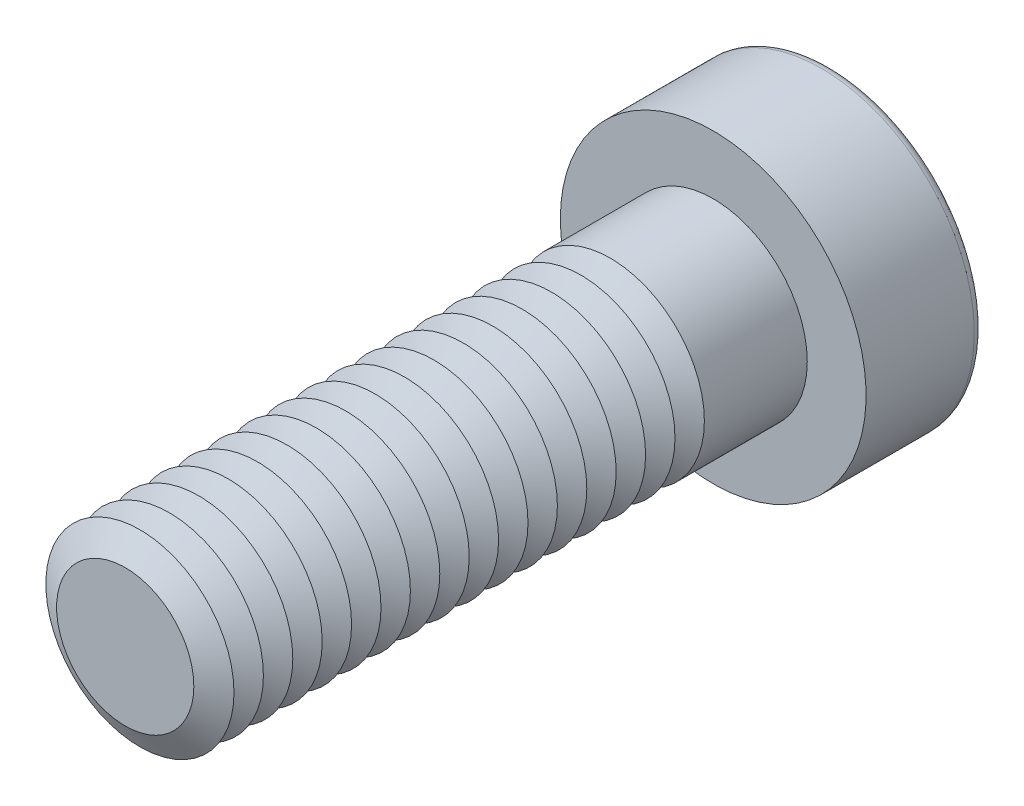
ISO-10303-21;
HEADER;
FILE_DESCRIPTION(('STEP AP214'),'2;1');
FILE_NAME('part.step','',(''),(''),'','','');
FILE_SCHEMA(('AUTOMOTIVE_DESIGN { 1 0 10303 214 1 1 1 1 }'));
ENDSEC;
DATA;
#1=APPLICATION_CONTEXT('core data for automotive mechanical design processes');
#2=APPLICATION_PROTOCOL_DEFINITION('international standard','automotive_design',2000,#1);
#3=PRODUCT_CONTEXT('',#1,'mechanical');
#4=PRODUCT('Part','Part','',(#3));
#5=PRODUCT_RELATED_PRODUCT_CATEGORY('part','',(#4));
#6=PRODUCT_DEFINITION_FORMATION('','',#4);
#7=PRODUCT_DEFINITION_CONTEXT('part definition',#1,'design');
#8=PRODUCT_DEFINITION('design','',#6,#7);
#9=PRODUCT_DEFINITION_SHAPE('','',#8);
#10=(LENGTH_UNIT() NAMED_UNIT(*) SI_UNIT(.MILLI.,.METRE.));
#11=(NAMED_UNIT(*) PLANE_ANGLE_UNIT() SI_UNIT($,.RADIAN.));
#12=(NAMED_UNIT(*) SI_UNIT($,.STERADIAN.) SOLID_ANGLE_UNIT());
#13=UNCERTAINTY_MEASURE_WITH_UNIT(LENGTH_MEASURE(1.E-05),#10,'distance_accuracy_value','');
#14=(GEOMETRIC_REPRESENTATION_CONTEXT(3) GLOBAL_UNCERTAINTY_ASSIGNED_CONTEXT((#13)) GLOBAL_UNIT_ASSIGNED_CONTEXT((#10,
#11,#12)) REPRESENTATION_CONTEXT('',''));
#15=CARTESIAN_POINT('',(0.,0.,0.));
#16=DIRECTION('',(0.,0.,1.));
#17=DIRECTION('',(1.,0.,0.));
#18=AXIS2_PLACEMENT_3D('',#15,#16,#17);
#19=CARTESIAN_POINT('',(0.,0.,20.625));
#20=DIRECTION('',(0.,0.,1.));
#21=DIRECTION('',(1.,0.,0.));
#22=AXIS2_PLACEMENT_3D('',#19,#20,#21);
#23=CONICAL_SURFACE('',#22,4.,1.0471975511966);
#24=CARTESIAN_POINT('',(0.,0.,20.));
#25=DIRECTION('',(0.,0.,1.));
#26=DIRECTION('',(1.,0.,0.));
#27=AXIS2_PLACEMENT_3D('',#24,#25,#26);
#28=CIRCLE('',#27,2.91746824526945);
#29=CARTESIAN_POINT('',(2.91746824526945,0.,20.));
#30=VERTEX_POINT('',#29);
#31=EDGE_CURVE('E313',#30,#30,#28,.T.);
#32=ORIENTED_EDGE('',*,*,#31,.T.);
#33=EDGE_LOOP('',(#32));
#34=FACE_BOUND('',#33,.T.);
#35=CARTESIAN_POINT('',(0.,0.,20.625));
#36=DIRECTION('',(0.,0.,1.));
#37=DIRECTION('',(1.,0.,0.));
#38=AXIS2_PLACEMENT_3D('',#35,#36,#37);
#39=CIRCLE('',#38,4.);
#40=CARTESIAN_POINT('',(4.,0.,20.625));
#41=VERTEX_POINT('',#40);
#42=EDGE_CURVE('E316',#41,#41,#39,.T.);
#43=ORIENTED_EDGE('',*,*,#42,.F.);
#44=EDGE_LOOP('',(#43));
#45=FACE_BOUND('',#44,.T.);
#46=ADVANCED_FACE('F39',(#34,#45),#23,.T.);
#47=CARTESIAN_POINT('',(0.,0.,20.));
#48=DIRECTION('',(0.,0.,-1.));
#49=DIRECTION('',(-1.,0.,0.));
#50=AXIS2_PLACEMENT_3D('',#47,#48,#49);
#51=CONICAL_SURFACE('',#50,2.91746824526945,1.0471975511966);
#52=CARTESIAN_POINT('',(0.,0.,19.375));
#53=DIRECTION('',(0.,0.,1.));
#54=DIRECTION('',(1.,0.,0.));
#55=AXIS2_PLACEMENT_3D('',#52,#53,#54);
#56=CIRCLE('',#55,4.);
#57=CARTESIAN_POINT('',(4.,0.,19.375));
#58=VERTEX_POINT('',#57);
#59=EDGE_CURVE('E323',#58,#58,#56,.T.);
#60=ORIENTED_EDGE('',*,*,#59,.T.);
#61=EDGE_LOOP('',(#60));
#62=FACE_BOUND('',#61,.T.);
#63=ORIENTED_EDGE('',*,*,#31,.F.);
#64=EDGE_LOOP('',(#63));
#65=FACE_BOUND('',#64,.T.);
#66=ADVANCED_FACE('F245',(#62,#65),#51,.T.);
#67=CARTESIAN_POINT('',(0.,0.,25.));
#68=DIRECTION('',(0.,0.,1.));
#69=DIRECTION('',(1.,0.,0.));
#70=AXIS2_PLACEMENT_3D('',#67,#68,#69);
#71=PLANE('',#70);
#72=CARTESIAN_POINT('',(0.,0.,25.));
#73=DIRECTION('',(0.,0.,1.));
#74=DIRECTION('',(1.,0.,0.));
#75=AXIS2_PLACEMENT_3D('',#72,#73,#74);
#76=CIRCLE('',#75,2.91746824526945);
#77=CARTESIAN_POINT('',(2.91746824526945,0.,25.));
#78=VERTEX_POINT('',#77);
#79=EDGE_CURVE('E174',#78,#78,#76,.T.);
#80=ORIENTED_EDGE('',*,*,#79,.T.);
#81=EDGE_LOOP('',(#80));
#82=FACE_BOUND('',#81,.T.);
#83=ADVANCED_FACE('F251',(#82),#71,.T.);
#84=CARTESIAN_POINT('',(0.,0.,25.));
#85=DIRECTION('',(0.,0.,-1.));
#86=DIRECTION('',(-1.,0.,0.));
#87=AXIS2_PLACEMENT_3D('',#84,#85,#86);
#88=CONICAL_SURFACE('',#87,2.91746824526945,1.0471975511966);
#89=CARTESIAN_POINT('',(0.,0.,24.375));
#90=DIRECTION('',(0.,0.,1.));
#91=DIRECTION('',(1.,0.,0.));
#92=AXIS2_PLACEMENT_3D('',#89,#90,#91);
#93=CIRCLE('',#92,4.);
#94=CARTESIAN_POINT('',(4.,0.,24.375));
#95=VERTEX_POINT('',#94);
#96=EDGE_CURVE('E291',#95,#95,#93,.T.);
#97=ORIENTED_EDGE('',*,*,#96,.T.);
#98=EDGE_LOOP('',(#97));
#99=FACE_BOUND('',#98,.T.);
#100=ORIENTED_EDGE('',*,*,#79,.F.);
#101=EDGE_LOOP('',(#100));
#102=FACE_BOUND('',#101,.T.);
#103=ADVANCED_FACE('F199',(#99,#102),#88,.T.);
#104=CARTESIAN_POINT('',(0.,0.,24.375));
#105=DIRECTION('',(0.,0.,1.));
#106=DIRECTION('',(1.,0.,0.));
#107=AXIS2_PLACEMENT_3D('',#104,#105,#106);
#108=CONICAL_SURFACE('',#107,4.,1.0471975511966);
#109=CARTESIAN_POINT('',(0.,0.,23.75));
#110=DIRECTION('',(0.,0.,1.));
#111=DIRECTION('',(1.,0.,0.));
#112=AXIS2_PLACEMENT_3D('',#109,#110,#111);
#113=CIRCLE('',#112,2.91746824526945);
#114=CARTESIAN_POINT('',(2.91746824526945,0.,23.75));
#115=VERTEX_POINT('',#114);
#116=EDGE_CURVE('E288',#115,#115,#113,.T.);
#117=ORIENTED_EDGE('',*,*,#116,.T.);
#118=EDGE_LOOP('',(#117));
#119=FACE_BOUND('',#118,.T.);
#120=ORIENTED_EDGE('',*,*,#96,.F.);
#121=EDGE_LOOP('',(#120));
#122=FACE_BOUND('',#121,.T.);
#123=ADVANCED_FACE('F277',(#119,#122),#108,.T.);
#124=CARTESIAN_POINT('',(0.,0.,23.75));
#125=DIRECTION('',(0.,0.,-1.));
#126=DIRECTION('',(-1.,0.,0.));
#127=AXIS2_PLACEMENT_3D('',#124,#125,#126);
#128=CONICAL_SURFACE('',#127,2.91746824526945,1.0471975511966);
#129=CARTESIAN_POINT('',(0.,0.,23.125));
#130=DIRECTION('',(0.,0.,1.));
#131=DIRECTION('',(1.,0.,0.));
#132=AXIS2_PLACEMENT_3D('',#129,#130,#131);
#133=CIRCLE('',#132,4.);
#134=CARTESIAN_POINT('',(4.,0.,23.125));
#135=VERTEX_POINT('',#134);
#136=EDGE_CURVE('E299',#135,#135,#133,.T.);
#137=ORIENTED_EDGE('',*,*,#136,.T.);
#138=EDGE_LOOP('',(#137));
#139=FACE_BOUND('',#138,.T.);
#140=ORIENTED_EDGE('',*,*,#116,.F.);
#141=EDGE_LOOP('',(#140));
#142=FACE_BOUND('',#141,.T.);
#143=ADVANCED_FACE('F274',(#139,#142),#128,.T.);
#144=CARTESIAN_POINT('',(0.,0.,23.125));
#145=DIRECTION('',(0.,0.,1.));
#146=DIRECTION('',(1.,0.,0.));
#147=AXIS2_PLACEMENT_3D('',#144,#145,#146);
#148=CONICAL_SURFACE('',#147,4.,1.0471975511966);
#149=CARTESIAN_POINT('',(0.,0.,22.5));
#150=DIRECTION('',(0.,0.,1.));
#151=DIRECTION('',(1.,0.,0.));
#152=AXIS2_PLACEMENT_3D('',#149,#150,#151);
#153=CIRCLE('',#152,2.91746824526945);
#154=CARTESIAN_POINT('',(2.91746824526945,0.,22.5));
#155=VERTEX_POINT('',#154);
#156=EDGE_CURVE('E293',#155,#155,#153,.T.);
#157=ORIENTED_EDGE('',*,*,#156,.T.);
#158=EDGE_LOOP('',(#157));
#159=FACE_BOUND('',#158,.T.);
#160=ORIENTED_EDGE('',*,*,#136,.F.);
#161=EDGE_LOOP('',(#160));
#162=FACE_BOUND('',#161,.T.);
#163=ADVANCED_FACE('F270',(#159,#162),#148,.T.);
#164=CARTESIAN_POINT('',(0.,0.,22.5));
#165=DIRECTION('',(0.,0.,-1.));
#166=DIRECTION('',(-1.,0.,0.));
#167=AXIS2_PLACEMENT_3D('',#164,#165,#166);
#168=CONICAL_SURFACE('',#167,2.91746824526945,1.0471975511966);
#169=CARTESIAN_POINT('',(0.,0.,21.875));
#170=DIRECTION('',(0.,0.,1.));
#171=DIRECTION('',(1.,0.,0.));
#172=AXIS2_PLACEMENT_3D('',#169,#170,#171);
#173=CIRCLE('',#172,4.);
#174=CARTESIAN_POINT('',(4.,0.,21.875));
#175=VERTEX_POINT('',#174);
#176=EDGE_CURVE('E309',#175,#175,#173,.T.);
#177=ORIENTED_EDGE('',*,*,#176,.T.);
#178=EDGE_LOOP('',(#177));
#179=FACE_BOUND('',#178,.T.);
#180=ORIENTED_EDGE('',*,*,#156,.F.);
#181=EDGE_LOOP('',(#180));
#182=FACE_BOUND('',#181,.T.);
#183=ADVANCED_FACE('F266',(#179,#182),#168,.T.);
#184=CARTESIAN_POINT('',(0.,0.,21.875));
#185=DIRECTION('',(0.,0.,1.));
#186=DIRECTION('',(1.,0.,0.));
#187=AXIS2_PLACEMENT_3D('',#184,#185,#186);
#188=CONICAL_SURFACE('',#187,4.,1.0471975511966);
#189=CARTESIAN_POINT('',(0.,0.,21.25));
#190=DIRECTION('',(0.,0.,1.));
#191=DIRECTION('',(1.,0.,0.));
#192=AXIS2_PLACEMENT_3D('',#189,#190,#191);
#193=CIRCLE('',#192,2.91746824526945);
#194=CARTESIAN_POINT('',(2.91746824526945,0.,21.25));
#195=VERTEX_POINT('',#194);
#196=EDGE_CURVE('E305',#195,#195,#193,.T.);
#197=ORIENTED_EDGE('',*,*,#196,.T.);
#198=EDGE_LOOP('',(#197));
#199=FACE_BOUND('',#198,.T.);
#200=ORIENTED_EDGE('',*,*,#176,.F.);
#201=EDGE_LOOP('',(#200));
#202=FACE_BOUND('',#201,.T.);
#203=ADVANCED_FACE('F262',(#199,#202),#188,.T.);
#204=CARTESIAN_POINT('',(0.,0.,21.25));
#205=DIRECTION('',(0.,0.,-1.));
#206=DIRECTION('',(-1.,0.,0.));
#207=AXIS2_PLACEMENT_3D('',#204,#205,#206);
#208=CONICAL_SURFACE('',#207,2.91746824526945,1.0471975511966);
#209=ORIENTED_EDGE('',*,*,#42,.T.);
#210=EDGE_LOOP('',(#209));
#211=FACE_BOUND('',#210,.T.);
#212=ORIENTED_EDGE('',*,*,#196,.F.);
#213=EDGE_LOOP('',(#212));
#214=FACE_BOUND('',#213,.T.);
#215=ADVANCED_FACE('F258',(#211,#214),#208,.T.);
#216=CARTESIAN_POINT('',(0.,0.,19.375));
#217=DIRECTION('',(0.,0.,1.));
#218=DIRECTION('',(1.,0.,0.));
#219=AXIS2_PLACEMENT_3D('',#216,#217,#218);
#220=CONICAL_SURFACE('',#219,4.,1.0471975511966);
#221=CARTESIAN_POINT('',(0.,0.,18.75));
#222=DIRECTION('',(0.,0.,1.));
#223=DIRECTION('',(1.,0.,0.));
#224=AXIS2_PLACEMENT_3D('',#221,#222,#223);
#225=CIRCLE('',#224,2.91746824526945);
#226=CARTESIAN_POINT('',(2.91746824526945,0.,18.75));
#227=VERTEX_POINT('',#226);
#228=EDGE_CURVE('E319',#227,#227,#225,.T.);
#229=ORIENTED_EDGE('',*,*,#228,.T.);
#230=EDGE_LOOP('',(#229));
#231=FACE_BOUND('',#230,.T.);
#232=ORIENTED_EDGE('',*,*,#59,.F.);
#233=EDGE_LOOP('',(#232));
#234=FACE_BOUND('',#233,.T.);
#235=ADVANCED_FACE('F261',(#231,#234),#220,.T.);
#236=CARTESIAN_POINT('',(0.,0.,18.75));
#237=DIRECTION('',(0.,0.,-1.));
#238=DIRECTION('',(-1.,0.,0.));
#239=AXIS2_PLACEMENT_3D('',#236,#237,#238);
#240=CONICAL_SURFACE('',#239,2.91746824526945,1.0471975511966);
#241=CARTESIAN_POINT('',(0.,0.,18.125));
#242=DIRECTION('',(0.,0.,1.));
#243=DIRECTION('',(1.,0.,0.));
#244=AXIS2_PLACEMENT_3D('',#241,#242,#243);
#245=CIRCLE('',#244,4.);
#246=CARTESIAN_POINT('',(4.,0.,18.125));
#247=VERTEX_POINT('',#246);
#248=EDGE_CURVE('E330',#247,#247,#245,.T.);
#249=ORIENTED_EDGE('',*,*,#248,.T.);
#250=EDGE_LOOP('',(#249));
#251=FACE_BOUND('',#250,.T.);
#252=ORIENTED_EDGE('',*,*,#228,.F.);
#253=EDGE_LOOP('',(#252));
#254=FACE_BOUND('',#253,.T.);
#255=ADVANCED_FACE('F511',(#251,#254),#240,.T.);
#256=CARTESIAN_POINT('',(0.,0.,18.125));
#257=DIRECTION('',(0.,0.,1.));
#258=DIRECTION('',(1.,0.,0.));
#259=AXIS2_PLACEMENT_3D('',#256,#257,#258);
#260=CONICAL_SURFACE('',#259,4.,1.0471975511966);
#261=CARTESIAN_POINT('',(0.,0.,17.5));
#262=DIRECTION('',(0.,0.,1.));
#263=DIRECTION('',(1.,0.,0.));
#264=AXIS2_PLACEMENT_3D('',#261,#262,#263);
#265=CIRCLE('',#264,2.91746824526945);
#266=CARTESIAN_POINT('',(2.91746824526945,0.,17.5));
#267=VERTEX_POINT('',#266);
#268=EDGE_CURVE('E327',#267,#267,#265,.T.);
#269=ORIENTED_EDGE('',*,*,#268,.T.);
#270=EDGE_LOOP('',(#269));
#271=FACE_BOUND('',#270,.T.);
#272=ORIENTED_EDGE('',*,*,#248,.F.);
#273=EDGE_LOOP('',(#272));
#274=FACE_BOUND('',#273,.T.);
#275=ADVANCED_FACE('F507',(#271,#274),#260,.T.);
#276=CARTESIAN_POINT('',(0.,0.,17.5));
#277=DIRECTION('',(0.,0.,-1.));
#278=DIRECTION('',(-1.,0.,0.));
#279=AXIS2_PLACEMENT_3D('',#276,#277,#278);
#280=CONICAL_SURFACE('',#279,2.91746824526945,1.0471975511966);
#281=CARTESIAN_POINT('',(0.,0.,16.875));
#282=DIRECTION('',(0.,0.,1.));
#283=DIRECTION('',(1.,0.,0.));
#284=AXIS2_PLACEMENT_3D('',#281,#282,#283);
#285=CIRCLE('',#284,4.);
#286=CARTESIAN_POINT('',(4.,0.,16.875));
#287=VERTEX_POINT('',#286);
#288=EDGE_CURVE('E338',#287,#287,#285,.T.);
#289=ORIENTED_EDGE('',*,*,#288,.T.);
#290=EDGE_LOOP('',(#289));
#291=FACE_BOUND('',#290,.T.);
#292=ORIENTED_EDGE('',*,*,#268,.F.);
#293=EDGE_LOOP('',(#292));
#294=FACE_BOUND('',#293,.T.);
#295=ADVANCED_FACE('F503',(#291,#294),#280,.T.);
#296=CARTESIAN_POINT('',(0.,0.,16.875));
#297=DIRECTION('',(0.,0.,1.));
#298=DIRECTION('',(1.,0.,0.));
#299=AXIS2_PLACEMENT_3D('',#296,#297,#298);
#300=CONICAL_SURFACE('',#299,4.,1.0471975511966);
#301=CARTESIAN_POINT('',(0.,0.,16.25));
#302=DIRECTION('',(0.,0.,1.));
#303=DIRECTION('',(1.,0.,0.));
#304=AXIS2_PLACEMENT_3D('',#301,#302,#303);
#305=CIRCLE('',#304,2.91746824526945);
#306=CARTESIAN_POINT('',(2.91746824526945,0.,16.25));
#307=VERTEX_POINT('',#306);
#308=EDGE_CURVE('E334',#307,#307,#305,.T.);
#309=ORIENTED_EDGE('',*,*,#308,.T.);
#310=EDGE_LOOP('',(#309));
#311=FACE_BOUND('',#310,.T.);
#312=ORIENTED_EDGE('',*,*,#288,.F.);
#313=EDGE_LOOP('',(#312));
#314=FACE_BOUND('',#313,.T.);
#315=ADVANCED_FACE('F499',(#311,#314),#300,.T.);
#316=CARTESIAN_POINT('',(0.,0.,16.25));
#317=DIRECTION('',(0.,0.,-1.));
#318=DIRECTION('',(-1.,0.,0.));
#319=AXIS2_PLACEMENT_3D('',#316,#317,#318);
#320=CONICAL_SURFACE('',#319,2.91746824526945,1.0471975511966);
#321=CARTESIAN_POINT('',(0.,0.,15.625));
#322=DIRECTION('',(0.,0.,1.));
#323=DIRECTION('',(1.,0.,0.));
#324=AXIS2_PLACEMENT_3D('',#321,#322,#323);
#325=CIRCLE('',#324,4.);
#326=CARTESIAN_POINT('',(4.,0.,15.625));
#327=VERTEX_POINT('',#326);
#328=EDGE_CURVE('E346',#327,#327,#325,.T.);
#329=ORIENTED_EDGE('',*,*,#328,.T.);
#330=EDGE_LOOP('',(#329));
#331=FACE_BOUND('',#330,.T.);
#332=ORIENTED_EDGE('',*,*,#308,.F.);
#333=EDGE_LOOP('',(#332));
#334=FACE_BOUND('',#333,.T.);
#335=ADVANCED_FACE('F495',(#331,#334),#320,.T.);
#336=CARTESIAN_POINT('',(0.,0.,15.625));
#337=DIRECTION('',(0.,0.,1.));
#338=DIRECTION('',(1.,0.,0.));
#339=AXIS2_PLACEMENT_3D('',#336,#337,#338);
#340=CONICAL_SURFACE('',#339,4.,1.0471975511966);
#341=CARTESIAN_POINT('',(0.,0.,15.));
#342=DIRECTION('',(0.,0.,1.));
#343=DIRECTION('',(1.,0.,0.));
#344=AXIS2_PLACEMENT_3D('',#341,#342,#343);
#345=CIRCLE('',#344,2.91746824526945);
#346=CARTESIAN_POINT('',(2.91746824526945,0.,15.));
#347=VERTEX_POINT('',#346);
#348=EDGE_CURVE('E342',#347,#347,#345,.T.);
#349=ORIENTED_EDGE('',*,*,#348,.T.);
#350=EDGE_LOOP('',(#349));
#351=FACE_BOUND('',#350,.T.);
#352=ORIENTED_EDGE('',*,*,#328,.F.);
#353=EDGE_LOOP('',(#352));
#354=FACE_BOUND('',#353,.T.);
#355=ADVANCED_FACE('F491',(#351,#354),#340,.T.);
#356=CARTESIAN_POINT('',(0.,0.,15.));
#357=DIRECTION('',(0.,0.,-1.));
#358=DIRECTION('',(-1.,0.,0.));
#359=AXIS2_PLACEMENT_3D('',#356,#357,#358);
#360=CONICAL_SURFACE('',#359,2.91746824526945,1.0471975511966);
#361=CARTESIAN_POINT('',(0.,0.,14.375));
#362=DIRECTION('',(0.,0.,1.));
#363=DIRECTION('',(1.,0.,0.));
#364=AXIS2_PLACEMENT_3D('',#361,#362,#363);
#365=CIRCLE('',#364,4.);
#366=CARTESIAN_POINT('',(4.,0.,14.375));
#367=VERTEX_POINT('',#366);
#368=EDGE_CURVE('E354',#367,#367,#365,.T.);
#369=ORIENTED_EDGE('',*,*,#368,.T.);
#370=EDGE_LOOP('',(#369));
#371=FACE_BOUND('',#370,.T.);
#372=ORIENTED_EDGE('',*,*,#348,.F.);
#373=EDGE_LOOP('',(#372));
#374=FACE_BOUND('',#373,.T.);
#375=ADVANCED_FACE('F487',(#371,#374),#360,.T.);
#376=CARTESIAN_POINT('',(0.,0.,14.375));
#377=DIRECTION('',(0.,0.,1.));
#378=DIRECTION('',(1.,0.,0.));
#379=AXIS2_PLACEMENT_3D('',#376,#377,#378);
#380=CONICAL_SURFACE('',#379,4.,1.0471975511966);
#381=CARTESIAN_POINT('',(0.,0.,13.75));
#382=DIRECTION('',(0.,0.,1.));
#383=DIRECTION('',(1.,0.,0.));
#384=AXIS2_PLACEMENT_3D('',#381,#382,#383);
#385=CIRCLE('',#384,2.91746824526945);
#386=CARTESIAN_POINT('',(2.91746824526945,0.,13.75));
#387=VERTEX_POINT('',#386);
#388=EDGE_CURVE('E350',#387,#387,#385,.T.);
#389=ORIENTED_EDGE('',*,*,#388,.T.);
#390=EDGE_LOOP('',(#389));
#391=FACE_BOUND('',#390,.T.);
#392=ORIENTED_EDGE('',*,*,#368,.F.);
#393=EDGE_LOOP('',(#392));
#394=FACE_BOUND('',#393,.T.);
#395=ADVANCED_FACE('F483',(#391,#394),#380,.T.);
#396=CARTESIAN_POINT('',(0.,0.,13.75));
#397=DIRECTION('',(0.,0.,-1.));
#398=DIRECTION('',(-1.,0.,0.));
#399=AXIS2_PLACEMENT_3D('',#396,#397,#398);
#400=CONICAL_SURFACE('',#399,2.91746824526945,1.0471975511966);
#401=CARTESIAN_POINT('',(0.,0.,13.125));
#402=DIRECTION('',(0.,0.,1.));
#403=DIRECTION('',(1.,0.,0.));
#404=AXIS2_PLACEMENT_3D('',#401,#402,#403);
#405=CIRCLE('',#404,4.);
#406=CARTESIAN_POINT('',(4.,0.,13.125));
#407=VERTEX_POINT('',#406);
#408=EDGE_CURVE('E362',#407,#407,#405,.T.);
#409=ORIENTED_EDGE('',*,*,#408,.T.);
#410=EDGE_LOOP('',(#409));
#411=FACE_BOUND('',#410,.T.);
#412=ORIENTED_EDGE('',*,*,#388,.F.);
#413=EDGE_LOOP('',(#412));
#414=FACE_BOUND('',#413,.T.);
#415=ADVANCED_FACE('F479',(#411,#414),#400,.T.);
#416=CARTESIAN_POINT('',(0.,0.,13.125));
#417=DIRECTION('',(0.,0.,1.));
#418=DIRECTION('',(1.,0.,0.));
#419=AXIS2_PLACEMENT_3D('',#416,#417,#418);
#420=CONICAL_SURFACE('',#419,4.,1.0471975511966);
#421=CARTESIAN_POINT('',(0.,0.,12.5));
#422=DIRECTION('',(0.,0.,1.));
#423=DIRECTION('',(1.,0.,0.));
#424=AXIS2_PLACEMENT_3D('',#421,#422,#423);
#425=CIRCLE('',#424,2.91746824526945);
#426=CARTESIAN_POINT('',(2.91746824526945,0.,12.5));
#427=VERTEX_POINT('',#426);
#428=EDGE_CURVE('E358',#427,#427,#425,.T.);
#429=ORIENTED_EDGE('',*,*,#428,.T.);
#430=EDGE_LOOP('',(#429));
#431=FACE_BOUND('',#430,.T.);
#432=ORIENTED_EDGE('',*,*,#408,.F.);
#433=EDGE_LOOP('',(#432));
#434=FACE_BOUND('',#433,.T.);
#435=ADVANCED_FACE('F475',(#431,#434),#420,.T.);
#436=CARTESIAN_POINT('',(0.,0.,12.5));
#437=DIRECTION('',(0.,0.,-1.));
#438=DIRECTION('',(-1.,0.,0.));
#439=AXIS2_PLACEMENT_3D('',#436,#437,#438);
#440=CONICAL_SURFACE('',#439,2.91746824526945,1.0471975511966);
#441=CARTESIAN_POINT('',(0.,0.,11.875));
#442=DIRECTION('',(0.,0.,1.));
#443=DIRECTION('',(1.,0.,0.));
#444=AXIS2_PLACEMENT_3D('',#441,#442,#443);
#445=CIRCLE('',#444,4.);
#446=CARTESIAN_POINT('',(4.,0.,11.875));
#447=VERTEX_POINT('',#446);
#448=EDGE_CURVE('E370',#447,#447,#445,.T.);
#449=ORIENTED_EDGE('',*,*,#448,.T.);
#450=EDGE_LOOP('',(#449));
#451=FACE_BOUND('',#450,.T.);
#452=ORIENTED_EDGE('',*,*,#428,.F.);
#453=EDGE_LOOP('',(#452));
#454=FACE_BOUND('',#453,.T.);
#455=ADVANCED_FACE('F471',(#451,#454),#440,.T.);
#456=CARTESIAN_POINT('',(0.,0.,11.875));
#457=DIRECTION('',(0.,0.,1.));
#458=DIRECTION('',(1.,0.,0.));
#459=AXIS2_PLACEMENT_3D('',#456,#457,#458);
#460=CONICAL_SURFACE('',#459,4.,1.0471975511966);
#461=CARTESIAN_POINT('',(0.,0.,11.25));
#462=DIRECTION('',(0.,0.,1.));
#463=DIRECTION('',(1.,0.,0.));
#464=AXIS2_PLACEMENT_3D('',#461,#462,#463);
#465=CIRCLE('',#464,2.91746824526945);
#466=CARTESIAN_POINT('',(2.91746824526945,0.,11.25));
#467=VERTEX_POINT('',#466);
#468=EDGE_CURVE('E366',#467,#467,#465,.T.);
#469=ORIENTED_EDGE('',*,*,#468,.T.);
#470=EDGE_LOOP('',(#469));
#471=FACE_BOUND('',#470,.T.);
#472=ORIENTED_EDGE('',*,*,#448,.F.);
#473=EDGE_LOOP('',(#472));
#474=FACE_BOUND('',#473,.T.);
#475=ADVANCED_FACE('F467',(#471,#474),#460,.T.);
#476=CARTESIAN_POINT('',(0.,0.,11.25));
#477=DIRECTION('',(0.,0.,-1.));
#478=DIRECTION('',(-1.,0.,0.));
#479=AXIS2_PLACEMENT_3D('',#476,#477,#478);
#480=CONICAL_SURFACE('',#479,2.91746824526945,1.0471975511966);
#481=CARTESIAN_POINT('',(0.,0.,10.625));
#482=DIRECTION('',(0.,0.,1.));
#483=DIRECTION('',(1.,0.,0.));
#484=AXIS2_PLACEMENT_3D('',#481,#482,#483);
#485=CIRCLE('',#484,4.);
#486=CARTESIAN_POINT('',(4.,0.,10.625));
#487=VERTEX_POINT('',#486);
#488=EDGE_CURVE('E378',#487,#487,#485,.T.);
#489=ORIENTED_EDGE('',*,*,#488,.T.);
#490=EDGE_LOOP('',(#489));
#491=FACE_BOUND('',#490,.T.);
#492=ORIENTED_EDGE('',*,*,#468,.F.);
#493=EDGE_LOOP('',(#492));
#494=FACE_BOUND('',#493,.T.);
#495=ADVANCED_FACE('F463',(#491,#494),#480,.T.);
#496=CARTESIAN_POINT('',(0.,0.,10.625));
#497=DIRECTION('',(0.,0.,1.));
#498=DIRECTION('',(1.,0.,0.));
#499=AXIS2_PLACEMENT_3D('',#496,#497,#498);
#500=CONICAL_SURFACE('',#499,4.,1.0471975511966);
#501=CARTESIAN_POINT('',(0.,0.,10.));
#502=DIRECTION('',(0.,0.,1.));
#503=DIRECTION('',(1.,0.,0.));
#504=AXIS2_PLACEMENT_3D('',#501,#502,#503);
#505=CIRCLE('',#504,2.91746824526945);
#506=CARTESIAN_POINT('',(2.91746824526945,0.,10.));
#507=VERTEX_POINT('',#506);
#508=EDGE_CURVE('E374',#507,#507,#505,.T.);
#509=ORIENTED_EDGE('',*,*,#508,.T.);
#510=EDGE_LOOP('',(#509));
#511=FACE_BOUND('',#510,.T.);
#512=ORIENTED_EDGE('',*,*,#488,.F.);
#513=EDGE_LOOP('',(#512));
#514=FACE_BOUND('',#513,.T.);
#515=ADVANCED_FACE('F459',(#511,#514),#500,.T.);
#516=CARTESIAN_POINT('',(0.,0.,10.));
#517=DIRECTION('',(0.,0.,-1.));
#518=DIRECTION('',(-1.,0.,0.));
#519=AXIS2_PLACEMENT_3D('',#516,#517,#518);
#520=CONICAL_SURFACE('',#519,2.91746824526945,1.0471975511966);
#521=CARTESIAN_POINT('',(0.,0.,9.375));
#522=DIRECTION('',(0.,0.,1.));
#523=DIRECTION('',(1.,0.,0.));
#524=AXIS2_PLACEMENT_3D('',#521,#522,#523);
#525=CIRCLE('',#524,4.);
#526=CARTESIAN_POINT('',(4.,0.,9.375));
#527=VERTEX_POINT('',#526);
#528=EDGE_CURVE('E386',#527,#527,#525,.T.);
#529=ORIENTED_EDGE('',*,*,#528,.T.);
#530=EDGE_LOOP('',(#529));
#531=FACE_BOUND('',#530,.T.);
#532=ORIENTED_EDGE('',*,*,#508,.F.);
#533=EDGE_LOOP('',(#532));
#534=FACE_BOUND('',#533,.T.);
#535=ADVANCED_FACE('F455',(#531,#534),#520,.T.);
#536=CARTESIAN_POINT('',(0.,0.,9.375));
#537=DIRECTION('',(0.,0.,1.));
#538=DIRECTION('',(1.,0.,0.));
#539=AXIS2_PLACEMENT_3D('',#536,#537,#538);
#540=CONICAL_SURFACE('',#539,4.,1.0471975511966);
#541=CARTESIAN_POINT('',(0.,0.,8.75));
#542=DIRECTION('',(0.,0.,1.));
#543=DIRECTION('',(1.,0.,0.));
#544=AXIS2_PLACEMENT_3D('',#541,#542,#543);
#545=CIRCLE('',#544,2.91746824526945);
#546=CARTESIAN_POINT('',(2.91746824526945,0.,8.75));
#547=VERTEX_POINT('',#546);
#548=EDGE_CURVE('E382',#547,#547,#545,.T.);
#549=ORIENTED_EDGE('',*,*,#548,.T.);
#550=EDGE_LOOP('',(#549));
#551=FACE_BOUND('',#550,.T.);
#552=ORIENTED_EDGE('',*,*,#528,.F.);
#553=EDGE_LOOP('',(#552));
#554=FACE_BOUND('',#553,.T.);
#555=ADVANCED_FACE('F451',(#551,#554),#540,.T.);
#556=CARTESIAN_POINT('',(0.,0.,8.75));
#557=DIRECTION('',(0.,0.,-1.));
#558=DIRECTION('',(-1.,0.,0.));
#559=AXIS2_PLACEMENT_3D('',#556,#557,#558);
#560=CONICAL_SURFACE('',#559,2.91746824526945,1.0471975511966);
#561=CARTESIAN_POINT('',(0.,0.,8.125));
#562=DIRECTION('',(0.,0.,1.));
#563=DIRECTION('',(1.,0.,0.));
#564=AXIS2_PLACEMENT_3D('',#561,#562,#563);
#565=CIRCLE('',#564,4.);
#566=CARTESIAN_POINT('',(4.,0.,8.125));
#567=VERTEX_POINT('',#566);
#568=EDGE_CURVE('E394',#567,#567,#565,.T.);
#569=ORIENTED_EDGE('',*,*,#568,.T.);
#570=EDGE_LOOP('',(#569));
#571=FACE_BOUND('',#570,.T.);
#572=ORIENTED_EDGE('',*,*,#548,.F.);
#573=EDGE_LOOP('',(#572));
#574=FACE_BOUND('',#573,.T.);
#575=ADVANCED_FACE('F447',(#571,#574),#560,.T.);
#576=CARTESIAN_POINT('',(0.,0.,8.125));
#577=DIRECTION('',(0.,0.,1.));
#578=DIRECTION('',(1.,0.,0.));
#579=AXIS2_PLACEMENT_3D('',#576,#577,#578);
#580=CONICAL_SURFACE('',#579,4.,1.0471975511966);
#581=CARTESIAN_POINT('',(0.,0.,7.5));
#582=DIRECTION('',(0.,0.,1.));
#583=DIRECTION('',(1.,0.,0.));
#584=AXIS2_PLACEMENT_3D('',#581,#582,#583);
#585=CIRCLE('',#584,2.91746824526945);
#586=CARTESIAN_POINT('',(2.91746824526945,0.,7.5));
#587=VERTEX_POINT('',#586);
#588=EDGE_CURVE('E390',#587,#587,#585,.T.);
#589=ORIENTED_EDGE('',*,*,#588,.T.);
#590=EDGE_LOOP('',(#589));
#591=FACE_BOUND('',#590,.T.);
#592=ORIENTED_EDGE('',*,*,#568,.F.);
#593=EDGE_LOOP('',(#592));
#594=FACE_BOUND('',#593,.T.);
#595=ADVANCED_FACE('F443',(#591,#594),#580,.T.);
#596=CARTESIAN_POINT('',(0.,0.,7.5));
#597=DIRECTION('',(0.,0.,-1.));
#598=DIRECTION('',(-1.,0.,0.));
#599=AXIS2_PLACEMENT_3D('',#596,#597,#598);
#600=CONICAL_SURFACE('',#599,2.91746824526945,1.0471975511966);
#601=CARTESIAN_POINT('',(0.,0.,6.875));
#602=DIRECTION('',(0.,0.,1.));
#603=DIRECTION('',(1.,0.,0.));
#604=AXIS2_PLACEMENT_3D('',#601,#602,#603);
#605=CIRCLE('',#604,4.);
#606=CARTESIAN_POINT('',(4.,0.,6.875));
#607=VERTEX_POINT('',#606);
#608=EDGE_CURVE('E402',#607,#607,#605,.T.);
#609=ORIENTED_EDGE('',*,*,#608,.T.);
#610=EDGE_LOOP('',(#609));
#611=FACE_BOUND('',#610,.T.);
#612=ORIENTED_EDGE('',*,*,#588,.F.);
#613=EDGE_LOOP('',(#612));
#614=FACE_BOUND('',#613,.T.);
#615=ADVANCED_FACE('F439',(#611,#614),#600,.T.);
#616=CARTESIAN_POINT('',(0.,0.,6.875));
#617=DIRECTION('',(0.,0.,1.));
#618=DIRECTION('',(1.,0.,0.));
#619=AXIS2_PLACEMENT_3D('',#616,#617,#618);
#620=CONICAL_SURFACE('',#619,4.,1.0471975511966);
#621=CARTESIAN_POINT('',(0.,0.,6.25));
#622=DIRECTION('',(0.,0.,1.));
#623=DIRECTION('',(1.,0.,0.));
#624=AXIS2_PLACEMENT_3D('',#621,#622,#623);
#625=CIRCLE('',#624,2.91746824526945);
#626=CARTESIAN_POINT('',(2.91746824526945,0.,6.25));
#627=VERTEX_POINT('',#626);
#628=EDGE_CURVE('E398',#627,#627,#625,.T.);
#629=ORIENTED_EDGE('',*,*,#628,.T.);
#630=EDGE_LOOP('',(#629));
#631=FACE_BOUND('',#630,.T.);
#632=ORIENTED_EDGE('',*,*,#608,.F.);
#633=EDGE_LOOP('',(#632));
#634=FACE_BOUND('',#633,.T.);
#635=ADVANCED_FACE('F434',(#631,#634),#620,.T.);
#636=CARTESIAN_POINT('',(0.,0.,6.25));
#637=DIRECTION('',(0.,0.,-1.));
#638=DIRECTION('',(-1.,0.,0.));
#639=AXIS2_PLACEMENT_3D('',#636,#637,#638);
#640=CONICAL_SURFACE('',#639,2.91746824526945,1.0471975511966);
#641=CARTESIAN_POINT('',(0.,0.,5.625));
#642=DIRECTION('',(0.,0.,1.));
#643=DIRECTION('',(1.,0.,0.));
#644=AXIS2_PLACEMENT_3D('',#641,#642,#643);
#645=CIRCLE('',#644,4.);
#646=CARTESIAN_POINT('',(4.,0.,5.625));
#647=VERTEX_POINT('',#646);
#648=EDGE_CURVE('E414',#647,#647,#645,.T.);
#649=ORIENTED_EDGE('',*,*,#648,.T.);
#650=EDGE_LOOP('',(#649));
#651=FACE_BOUND('',#650,.T.);
#652=ORIENTED_EDGE('',*,*,#628,.F.);
#653=EDGE_LOOP('',(#652));
#654=FACE_BOUND('',#653,.T.);
#655=ADVANCED_FACE('F420',(#651,#654),#640,.T.);
#656=CARTESIAN_POINT('',(0.,0.,5.625));
#657=DIRECTION('',(0.,0.,1.));
#658=DIRECTION('',(1.,0.,0.));
#659=AXIS2_PLACEMENT_3D('',#656,#657,#658);
#660=CONICAL_SURFACE('',#659,4.,1.0471975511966);
#661=CARTESIAN_POINT('',(0.,0.,5.));
#662=DIRECTION('',(0.,0.,1.));
#663=DIRECTION('',(1.,0.,0.));
#664=AXIS2_PLACEMENT_3D('',#661,#662,#663);
#665=CIRCLE('',#664,2.91746824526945);
#666=CARTESIAN_POINT('',(2.91746824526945,0.,5.));
#667=VERTEX_POINT('',#666);
#668=EDGE_CURVE('E406',#667,#667,#665,.T.);
#669=ORIENTED_EDGE('',*,*,#668,.T.);
#670=EDGE_LOOP('',(#669));
#671=FACE_BOUND('',#670,.T.);
#672=ORIENTED_EDGE('',*,*,#648,.F.);
#673=EDGE_LOOP('',(#672));
#674=FACE_BOUND('',#673,.T.);
#675=ADVANCED_FACE('F423',(#671,#674),#660,.T.);
#676=CARTESIAN_POINT('',(0.,0.,5.));
#677=DIRECTION('',(0.,0.,-1.));
#678=DIRECTION('',(-1.,0.,0.));
#679=AXIS2_PLACEMENT_3D('',#676,#677,#678);
#680=CONICAL_SURFACE('',#679,2.91746824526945,1.0471975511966);
#681=CARTESIAN_POINT('',(0.,0.,4.375));
#682=DIRECTION('',(0.,0.,1.));
#683=DIRECTION('',(1.,0.,0.));
#684=AXIS2_PLACEMENT_3D('',#681,#682,#683);
#685=CIRCLE('',#684,4.);
#686=CARTESIAN_POINT('',(4.,0.,4.375));
#687=VERTEX_POINT('',#686);
#688=EDGE_CURVE('E410',#687,#687,#685,.T.);
#689=ORIENTED_EDGE('',*,*,#688,.T.);
#690=EDGE_LOOP('',(#689));
#691=FACE_BOUND('',#690,.T.);
#692=ORIENTED_EDGE('',*,*,#668,.F.);
#693=EDGE_LOOP('',(#692));
#694=FACE_BOUND('',#693,.T.);
#695=ADVANCED_FACE('F425',(#691,#694),#680,.T.);
#696=CARTESIAN_POINT('',(0.,0.,-1.25));
#697=DIRECTION('',(0.,0.,-1.));
#698=DIRECTION('',(-1.,0.,0.));
#699=AXIS2_PLACEMENT_3D('',#696,#697,#698);
#700=CONICAL_SURFACE('',#699,2.5,1.0471975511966);
#701=CARTESIAN_POINT('',(0.,0.,0.193375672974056));
#702=VERTEX_POINT('',#701);
#703=VERTEX_LOOP('',#702);
#704=FACE_BOUND('',#703,.T.);
#705=CARTESIAN_POINT('',(0.,0.,-1.25));
#706=DIRECTION('',(0.,0.,-1.));
#707=DIRECTION('',(-1.,0.,0.));
#708=AXIS2_PLACEMENT_3D('',#705,#706,#707);
#709=CIRCLE('',#708,2.5);
#710=CARTESIAN_POINT('',(-2.1650635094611,1.25,-1.25));
#711=VERTEX_POINT('',#710);
#712=CARTESIAN_POINT('',(0.,2.5,-1.25));
#713=VERTEX_POINT('',#712);
#714=EDGE_CURVE('E149',#711,#713,#709,.T.);
#715=ORIENTED_EDGE('',*,*,#714,.T.);
#716=CARTESIAN_POINT('',(0.,0.,-1.25));
#717=DIRECTION('',(0.,0.,-1.));
#718=DIRECTION('',(-1.,0.,0.));
#719=AXIS2_PLACEMENT_3D('',#716,#717,#718);
#720=CIRCLE('',#719,2.5);
#721=CARTESIAN_POINT('',(2.1650635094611,1.25,-1.25));
#722=VERTEX_POINT('',#721);
#723=EDGE_CURVE('E54',#713,#722,#720,.T.);
#724=ORIENTED_EDGE('',*,*,#723,.T.);
#725=CARTESIAN_POINT('',(2.1650635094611,-1.25,-1.25));
#726=VERTEX_POINT('',#725);
#727=EDGE_CURVE('E1028',#722,#726,#720,.T.);
#728=ORIENTED_EDGE('',*,*,#727,.T.);
#729=CARTESIAN_POINT('',(0.,-2.5,-1.25));
#730=VERTEX_POINT('',#729);
#731=EDGE_CURVE('E1026',#726,#730,#720,.T.);
#732=ORIENTED_EDGE('',*,*,#731,.T.);
#733=CARTESIAN_POINT('',(-2.1650635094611,-1.25,-1.25));
#734=VERTEX_POINT('',#733);
#735=EDGE_CURVE('E1021',#730,#734,#720,.T.);
#736=ORIENTED_EDGE('',*,*,#735,.T.);
#737=EDGE_CURVE('E1019',#734,#711,#720,.T.);
#738=ORIENTED_EDGE('',*,*,#737,.T.);
#739=EDGE_LOOP('',(#715,#724,#728,#732,#736,#738));
#740=FACE_BOUND('',#739,.T.);
#741=ADVANCED_FACE('F201',(#704,#740),#700,.F.);
#742=CARTESIAN_POINT('',(0.,0.,-1.25));
#743=DIRECTION('',(0.,0.,-1.));
#744=DIRECTION('',(-1.,0.,0.));
#745=AXIS2_PLACEMENT_3D('',#742,#743,#744);
#746=PLANE('',#745);
#747=ORIENTED_EDGE('',*,*,#723,.F.);
#748=DIRECTION('',(1.,0.,0.));
#749=VECTOR('',#748,1.);
#750=CARTESIAN_POINT('',(-1.44337567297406,2.5,-1.25));
#751=LINE('',#750,#749);
#752=CARTESIAN_POINT('',(1.44337567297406,2.5,-1.25));
#753=VERTEX_POINT('',#752);
#754=EDGE_CURVE('E1065',#713,#753,#751,.T.);
#755=ORIENTED_EDGE('',*,*,#754,.T.);
#756=DIRECTION('',(0.5,-0.866025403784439,0.));
#757=VECTOR('',#756,1.);
#758=CARTESIAN_POINT('',(1.44337567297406,2.5,-1.25));
#759=LINE('',#758,#757);
#760=EDGE_CURVE('E155',#753,#722,#759,.T.);
#761=ORIENTED_EDGE('',*,*,#760,.T.);
#762=EDGE_LOOP('',(#747,#755,#761));
#763=FACE_BOUND('',#762,.T.);
#764=ADVANCED_FACE('F606',(#763),#746,.T.);
#765=ORIENTED_EDGE('',*,*,#727,.F.);
#766=CARTESIAN_POINT('',(2.88675134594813,0.,-1.25));
#767=VERTEX_POINT('',#766);
#768=EDGE_CURVE('E1069',#722,#767,#759,.T.);
#769=ORIENTED_EDGE('',*,*,#768,.T.);
#770=DIRECTION('',(-0.5,-0.866025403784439,0.));
#771=VECTOR('',#770,1.);
#772=CARTESIAN_POINT('',(2.88675134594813,0.,-1.25));
#773=LINE('',#772,#771);
#774=EDGE_CURVE('E1042',#767,#726,#773,.T.);
#775=ORIENTED_EDGE('',*,*,#774,.T.);
#776=EDGE_LOOP('',(#765,#769,#775));
#777=FACE_BOUND('',#776,.T.);
#778=ADVANCED_FACE('F616',(#777),#746,.T.);
#779=ORIENTED_EDGE('',*,*,#731,.F.);
#780=CARTESIAN_POINT('',(1.44337567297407,-2.5,-1.25));
#781=VERTEX_POINT('',#780);
#782=EDGE_CURVE('E1044',#726,#781,#773,.T.);
#783=ORIENTED_EDGE('',*,*,#782,.T.);
#784=DIRECTION('',(-1.,0.,0.));
#785=VECTOR('',#784,1.);
#786=CARTESIAN_POINT('',(1.44337567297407,-2.5,-1.25));
#787=LINE('',#786,#785);
#788=EDGE_CURVE('E992',#781,#730,#787,.T.);
#789=ORIENTED_EDGE('',*,*,#788,.T.);
#790=EDGE_LOOP('',(#779,#783,#789));
#791=FACE_BOUND('',#790,.T.);
#792=ADVANCED_FACE('F626',(#791),#746,.T.);
#793=ORIENTED_EDGE('',*,*,#735,.F.);
#794=CARTESIAN_POINT('',(-1.44337567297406,-2.5,-1.25));
#795=VERTEX_POINT('',#794);
#796=EDGE_CURVE('E1038',#730,#795,#787,.T.);
#797=ORIENTED_EDGE('',*,*,#796,.T.);
#798=DIRECTION('',(-0.5,0.866025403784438,0.));
#799=VECTOR('',#798,1.);
#800=CARTESIAN_POINT('',(-1.44337567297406,-2.5,-1.25));
#801=LINE('',#800,#799);
#802=EDGE_CURVE('E1040',#795,#734,#801,.T.);
#803=ORIENTED_EDGE('',*,*,#802,.T.);
#804=EDGE_LOOP('',(#793,#797,#803));
#805=FACE_BOUND('',#804,.T.);
#806=ADVANCED_FACE('F634',(#805),#746,.T.);
#807=ORIENTED_EDGE('',*,*,#737,.F.);
#808=CARTESIAN_POINT('',(-2.88675134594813,0.,-1.25));
#809=VERTEX_POINT('',#808);
#810=EDGE_CURVE('E1045',#734,#809,#801,.T.);
#811=ORIENTED_EDGE('',*,*,#810,.T.);
#812=DIRECTION('',(0.5,0.866025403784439,0.));
#813=VECTOR('',#812,1.);
#814=CARTESIAN_POINT('',(-2.88675134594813,0.,-1.25));
#815=LINE('',#814,#813);
#816=EDGE_CURVE('E158',#809,#711,#815,.T.);
#817=ORIENTED_EDGE('',*,*,#816,.T.);
#818=EDGE_LOOP('',(#807,#811,#817));
#819=FACE_BOUND('',#818,.T.);
#820=ADVANCED_FACE('F231',(#819),#746,.T.);
#821=ORIENTED_EDGE('',*,*,#714,.F.);
#822=CARTESIAN_POINT('',(-1.44337567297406,2.5,-1.25));
#823=VERTEX_POINT('',#822);
#824=EDGE_CURVE('E1052',#711,#823,#815,.T.);
#825=ORIENTED_EDGE('',*,*,#824,.T.);
#826=EDGE_CURVE('E1064',#823,#713,#751,.T.);
#827=ORIENTED_EDGE('',*,*,#826,.T.);
#828=EDGE_LOOP('',(#821,#825,#827));
#829=FACE_BOUND('',#828,.T.);
#830=ADVANCED_FACE('F618',(#829),#746,.T.);
#831=CARTESIAN_POINT('',(-1.44337567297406,2.5,-1.25));
#832=DIRECTION('',(0.,1.,0.));
#833=DIRECTION('',(-1.,0.,0.));
#834=AXIS2_PLACEMENT_3D('',#831,#832,#833);
#835=PLANE('',#834);
#836=DIRECTION('',(0.,0.,-1.));
#837=VECTOR('',#836,1.);
#838=CARTESIAN_POINT('',(-1.44337567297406,2.5,-1.25));
#839=LINE('',#838,#837);
#840=CARTESIAN_POINT('',(-1.44337567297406,2.5,-5.));
#841=VERTEX_POINT('',#840);
#842=EDGE_CURVE('E147',#823,#841,#839,.T.);
#843=ORIENTED_EDGE('',*,*,#842,.T.);
#844=CARTESIAN_POINT('',(-3.76800948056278,2.5,-5.43814611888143));
#845=CARTESIAN_POINT('',(-3.65512241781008,2.5,-5.41294788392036));
#846=CARTESIAN_POINT('',(-3.54216337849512,2.5,-5.38806689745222));
#847=CARTESIAN_POINT('',(-3.31606595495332,2.5,-5.33910944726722));
#848=CARTESIAN_POINT('',(-3.202927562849,2.5,-5.31503301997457));
#849=CARTESIAN_POINT('',(-2.97632910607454,2.5,-5.26783262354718));
#850=CARTESIAN_POINT('',(-2.86286882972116,2.5,-5.24470966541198));
#851=CARTESIAN_POINT('',(-2.63570880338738,2.5,-5.19967851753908));
#852=CARTESIAN_POINT('',(-2.522009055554,2.5,-5.17777031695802));
#853=CARTESIAN_POINT('',(-2.18246936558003,2.5,-5.11464083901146));
#854=CARTESIAN_POINT('',(-1.95621666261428,2.5,-5.07559469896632));
#855=CARTESIAN_POINT('',(-1.50233128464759,2.5,-5.00642421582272));
#856=CARTESIAN_POINT('',(-1.27469889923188,2.5,-4.97629806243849));
#857=CARTESIAN_POINT('',(-0.930935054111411,2.5,-4.9407375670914));
#858=CARTESIAN_POINT('',(-0.815306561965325,2.5,-4.93045885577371));
#859=CARTESIAN_POINT('',(-0.583775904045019,2.5,-4.91374261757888));
#860=CARTESIAN_POINT('',(-0.467873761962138,2.5,-4.9073047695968));
#861=CARTESIAN_POINT('',(-0.235955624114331,2.5,-4.89864425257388));
#862=CARTESIAN_POINT('',(-0.119939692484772,2.5,-4.89641989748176));
#863=CARTESIAN_POINT('',(0.11209426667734,2.5,-4.89632233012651));
#864=CARTESIAN_POINT('',(0.228112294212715,2.5,-4.89844912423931));
#865=CARTESIAN_POINT('',(0.460464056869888,2.5,-4.90693624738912));
#866=CARTESIAN_POINT('',(0.576797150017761,2.5,-4.91331380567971));
#867=CARTESIAN_POINT('',(0.809186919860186,2.5,-4.92994602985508));
#868=CARTESIAN_POINT('',(0.925243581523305,2.5,-4.94020090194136));
#869=CARTESIAN_POINT('',(1.1570783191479,2.5,-4.96408095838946));
#870=CARTESIAN_POINT('',(1.27285617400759,2.5,-4.97770825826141));
#871=CARTESIAN_POINT('',(1.50403978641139,2.5,-5.0077859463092));
#872=CARTESIAN_POINT('',(1.61944554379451,2.5,-5.02423633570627));
#873=CARTESIAN_POINT('',(1.97116037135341,2.5,-5.07794848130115));
#874=CARTESIAN_POINT('',(2.20690405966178,2.5,-5.11889404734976));
#875=CARTESIAN_POINT('',(2.67723558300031,2.5,-5.2069642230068));
#876=CARTESIAN_POINT('',(2.9118232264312,2.5,-5.25408982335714));
#877=CARTESIAN_POINT('',(3.38022088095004,2.5,-5.35235327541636));
#878=CARTESIAN_POINT('',(3.61403064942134,2.5,-5.40349227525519));
#879=CARTESIAN_POINT('',(4.08105387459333,2.5,-5.50842823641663));
#880=CARTESIAN_POINT('',(4.31426731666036,2.5,-5.56222526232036));
#881=CARTESIAN_POINT('',(4.77742011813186,2.5,-5.67097662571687));
#882=CARTESIAN_POINT('',(5.00736469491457,2.5,-5.72590882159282));
#883=CARTESIAN_POINT('',(5.46695141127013,2.5,-5.83704335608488));
#884=CARTESIAN_POINT('',(5.69659354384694,2.5,-5.89324572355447));
#885=CARTESIAN_POINT('',(6.15532898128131,2.5,-6.00649703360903));
#886=CARTESIAN_POINT('',(6.3844226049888,2.5,-6.06354468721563));
#887=CARTESIAN_POINT('',(6.84242442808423,2.5,-6.17834514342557));
#888=CARTESIAN_POINT('',(7.07133263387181,2.5,-6.23609792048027));
#889=CARTESIAN_POINT('',(7.30017784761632,2.5,-6.29409642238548));
#890=B_SPLINE_CURVE_WITH_KNOTS('',3,(#844,#845,#846,#847,#848,#849,#850,#851,#852,#853,#854,
#855,#856,#857,#858,#859,#860,#861,#862,#863,#864,#865,#866,#867,#868,#869,#870,#871,#872,#873,
#874,#875,#876,#877,#878,#879,#880,#881,#882,#883,#884,#885,#886,#887,#888,#889),.UNSPECIFIED.,
.F.,.F.,(4,2,2,2,2,2,2,2,2,2,2,2,2,2,2,2,2,2,2,2,2,2,4),(0.,0.346996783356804,0.694009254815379,
1.04138068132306,1.38874900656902,2.07743762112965,2.76598637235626,3.11418615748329,
3.46235682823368,3.81038814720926,4.15841997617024,4.50787110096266,4.85734081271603,
5.2070303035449,5.55671994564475,6.27438533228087,6.99216591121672,7.71015258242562,
8.42815670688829,9.13739674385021,9.84665290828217,10.5549206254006,11.2631627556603),.UNSPECIFIED.);
#891=CARTESIAN_POINT('',(1.44337567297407,2.5,-5.));
#892=VERTEX_POINT('',#891);
#893=EDGE_CURVE('E124',#841,#892,#890,.T.);
#894=ORIENTED_EDGE('',*,*,#893,.T.);
#895=DIRECTION('',(0.,0.,-1.));
#896=VECTOR('',#895,1.);
#897=CARTESIAN_POINT('',(1.44337567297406,2.5,-1.25));
#898=LINE('',#897,#896);
#899=EDGE_CURVE('E143',#753,#892,#898,.T.);
#900=ORIENTED_EDGE('',*,*,#899,.F.);
#901=ORIENTED_EDGE('',*,*,#754,.F.);
#902=ORIENTED_EDGE('',*,*,#826,.F.);
#903=EDGE_LOOP('',(#843,#894,#900,#901,#902));
#904=FACE_BOUND('',#903,.T.);
#905=ADVANCED_FACE('F141',(#904),#835,.F.);
#906=CARTESIAN_POINT('',(1.44337567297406,2.5,-1.25));
#907=DIRECTION('',(0.866025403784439,0.5,0.));
#908=DIRECTION('',(-0.5,0.866025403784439,0.));
#909=AXIS2_PLACEMENT_3D('',#906,#907,#908);
#910=PLANE('',#909);
#911=ORIENTED_EDGE('',*,*,#899,.T.);
#912=CARTESIAN_POINT('',(1.44326020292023,2.5002,-5.00003094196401));
#913=CARTESIAN_POINT('',(1.50320952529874,2.3963647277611,-4.98395956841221));
#914=CARTESIAN_POINT('',(1.56326755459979,2.29234116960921,-4.96936932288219));
#915=CARTESIAN_POINT('',(1.68359574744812,2.08392662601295,-4.94373552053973));
#916=CARTESIAN_POINT('',(1.7438659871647,1.97953550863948,-4.93269340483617));
#917=CARTESIAN_POINT('',(1.86425311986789,1.77101887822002,-4.91480059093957));
#918=CARTESIAN_POINT('',(1.9243691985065,1.66689477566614,-4.90792855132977));
#919=CARTESIAN_POINT('',(2.04467803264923,1.45851376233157,-4.89871383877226));
#920=CARTESIAN_POINT('',(2.10487077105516,1.35425688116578,-4.89637028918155));
#921=CARTESIAN_POINT('',(2.22525624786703,1.14574311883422,-4.89637028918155));
#922=CARTESIAN_POINT('',(2.28544898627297,1.04148623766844,-4.89871383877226));
#923=CARTESIAN_POINT('',(2.40575782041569,0.833105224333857,-4.90792855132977));
#924=CARTESIAN_POINT('',(2.4658738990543,0.728981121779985,-4.91480059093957));
#925=CARTESIAN_POINT('',(2.58626103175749,0.520464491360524,-4.93269340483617));
#926=CARTESIAN_POINT('',(2.64653127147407,0.416073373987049,-4.94373552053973));
#927=CARTESIAN_POINT('',(2.7668594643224,0.207658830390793,-4.96936932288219));
#928=CARTESIAN_POINT('',(2.82691749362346,0.103635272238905,-4.98395956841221));
#929=CARTESIAN_POINT('',(2.88686681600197,-0.000199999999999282,-5.00003094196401));
#930=B_SPLINE_CURVE_WITH_KNOTS('',3,(#912,#913,#914,#915,#916,#917,#918,#919,#920,#921,#922,
#923,#924,#925,#926,#927,#928,#929),.UNSPECIFIED.,.F.,.F.,(4,2,2,2,2,2,2,2,4),(0.,
0.362931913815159,0.726011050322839,1.08721601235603,1.44835104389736,1.80948607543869,
2.17069103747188,2.53377017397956,2.89670208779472),.UNSPECIFIED.);
#931=CARTESIAN_POINT('',(2.88675134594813,0.,-5.));
#932=VERTEX_POINT('',#931);
#933=EDGE_CURVE('E11',#892,#932,#930,.T.);
#934=ORIENTED_EDGE('',*,*,#933,.T.);
#935=DIRECTION('',(0.,0.,-1.));
#936=VECTOR('',#935,1.);
#937=CARTESIAN_POINT('',(2.88675134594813,0.,-1.25));
#938=LINE('',#937,#936);
#939=EDGE_CURVE('E157',#767,#932,#938,.T.);
#940=ORIENTED_EDGE('',*,*,#939,.F.);
#941=ORIENTED_EDGE('',*,*,#768,.F.);
#942=ORIENTED_EDGE('',*,*,#760,.F.);
#943=EDGE_LOOP('',(#911,#934,#940,#941,#942));
#944=FACE_BOUND('',#943,.T.);
#945=ADVANCED_FACE('F152',(#944),#910,.F.);
#946=CARTESIAN_POINT('',(2.88675134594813,0.,-1.25));
#947=DIRECTION('',(0.866025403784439,-0.5,0.));
#948=DIRECTION('',(0.5,0.866025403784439,0.));
#949=AXIS2_PLACEMENT_3D('',#946,#947,#948);
#950=PLANE('',#949);
#951=ORIENTED_EDGE('',*,*,#939,.T.);
#952=CARTESIAN_POINT('',(2.88686681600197,0.000200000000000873,-5.00003094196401));
#953=CARTESIAN_POINT('',(2.82691749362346,-0.103635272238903,-4.98395956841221));
#954=CARTESIAN_POINT('',(2.7668594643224,-0.207658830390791,-4.96936932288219));
#955=CARTESIAN_POINT('',(2.64653127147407,-0.416073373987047,-4.94373552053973));
#956=CARTESIAN_POINT('',(2.58626103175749,-0.520464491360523,-4.93269340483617));
#957=CARTESIAN_POINT('',(2.4658738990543,-0.728981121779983,-4.91480059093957));
#958=CARTESIAN_POINT('',(2.40575782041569,-0.833105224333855,-4.90792855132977));
#959=CARTESIAN_POINT('',(2.28544898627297,-1.04148623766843,-4.89871383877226));
#960=CARTESIAN_POINT('',(2.22525624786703,-1.14574311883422,-4.89637028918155));
#961=CARTESIAN_POINT('',(2.10487077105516,-1.35425688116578,-4.89637028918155));
#962=CARTESIAN_POINT('',(2.04467803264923,-1.45851376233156,-4.89871383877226));
#963=CARTESIAN_POINT('',(1.9243691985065,-1.66689477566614,-4.90792855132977));
#964=CARTESIAN_POINT('',(1.86425311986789,-1.77101887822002,-4.91480059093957));
#965=CARTESIAN_POINT('',(1.74386598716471,-1.97953550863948,-4.93269340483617));
#966=CARTESIAN_POINT('',(1.68359574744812,-2.08392662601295,-4.94373552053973));
#967=CARTESIAN_POINT('',(1.56326755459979,-2.29234116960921,-4.96936932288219));
#968=CARTESIAN_POINT('',(1.50320952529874,-2.3963647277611,-4.98395956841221));
#969=CARTESIAN_POINT('',(1.44326020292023,-2.5002,-5.00003094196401));
#970=B_SPLINE_CURVE_WITH_KNOTS('',3,(#952,#953,#954,#955,#956,#957,#958,#959,#960,#961,#962,
#963,#964,#965,#966,#967,#968,#969),.UNSPECIFIED.,.F.,.F.,(4,2,2,2,2,2,2,2,4),(0.,
0.362931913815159,0.726011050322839,1.08721601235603,1.44835104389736,1.80948607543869,
2.17069103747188,2.53377017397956,2.89670208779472),.UNSPECIFIED.);
#971=CARTESIAN_POINT('',(1.44337567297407,-2.5,-5.));
#972=VERTEX_POINT('',#971);
#973=EDGE_CURVE('E173',#932,#972,#970,.T.);
#974=ORIENTED_EDGE('',*,*,#973,.T.);
#975=DIRECTION('',(0.,0.,-1.));
#976=VECTOR('',#975,1.);
#977=CARTESIAN_POINT('',(1.44337567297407,-2.5,-1.25));
#978=LINE('',#977,#976);
#979=EDGE_CURVE('E987',#781,#972,#978,.T.);
#980=ORIENTED_EDGE('',*,*,#979,.F.);
#981=ORIENTED_EDGE('',*,*,#782,.F.);
#982=ORIENTED_EDGE('',*,*,#774,.F.);
#983=EDGE_LOOP('',(#951,#974,#980,#981,#982));
#984=FACE_BOUND('',#983,.T.);
#985=ADVANCED_FACE('F191',(#984),#950,.F.);
#986=CARTESIAN_POINT('',(1.44337567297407,-2.5,-1.25));
#987=DIRECTION('',(0.,-1.,0.));
#988=DIRECTION('',(1.,0.,0.));
#989=AXIS2_PLACEMENT_3D('',#986,#987,#988);
#990=PLANE('',#989);
#991=ORIENTED_EDGE('',*,*,#979,.T.);
#992=CARTESIAN_POINT('',(-3.76800948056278,-2.5,-5.43814611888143));
#993=CARTESIAN_POINT('',(-3.65512241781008,-2.5,-5.41294788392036));
#994=CARTESIAN_POINT('',(-3.54216337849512,-2.5,-5.38806689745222));
#995=CARTESIAN_POINT('',(-3.31606595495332,-2.5,-5.33910944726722));
#996=CARTESIAN_POINT('',(-3.202927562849,-2.5,-5.31503301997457));
#997=CARTESIAN_POINT('',(-2.97632910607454,-2.5,-5.26783262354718));
#998=CARTESIAN_POINT('',(-2.86286882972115,-2.5,-5.24470966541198));
#999=CARTESIAN_POINT('',(-2.63570880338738,-2.5,-5.19967851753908));
#1000=CARTESIAN_POINT('',(-2.522009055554,-2.5,-5.17777031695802));
#1001=CARTESIAN_POINT('',(-2.18246936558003,-2.5,-5.11464083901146));
#1002=CARTESIAN_POINT('',(-1.95621666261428,-2.5,-5.07559469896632));
#1003=CARTESIAN_POINT('',(-1.50233128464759,-2.5,-5.00642421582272));
#1004=CARTESIAN_POINT('',(-1.27469889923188,-2.5,-4.97629806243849));
#1005=CARTESIAN_POINT('',(-0.930935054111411,-2.5,-4.9407375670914));
#1006=CARTESIAN_POINT('',(-0.815306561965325,-2.5,-4.93045885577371));
#1007=CARTESIAN_POINT('',(-0.583775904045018,-2.5,-4.91374261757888));
#1008=CARTESIAN_POINT('',(-0.467873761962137,-2.5,-4.9073047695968));
#1009=CARTESIAN_POINT('',(-0.23595562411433,-2.5,-4.89864425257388));
#1010=CARTESIAN_POINT('',(-0.119939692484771,-2.5,-4.89641989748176));
#1011=CARTESIAN_POINT('',(0.112094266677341,-2.5,-4.89632233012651));
#1012=CARTESIAN_POINT('',(0.228112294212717,-2.5,-4.89844912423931));
#1013=CARTESIAN_POINT('',(0.460464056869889,-2.5,-4.90693624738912));
#1014=CARTESIAN_POINT('',(0.576797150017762,-2.5,-4.91331380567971));
#1015=CARTESIAN_POINT('',(0.809186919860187,-2.5,-4.92994602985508));
#1016=CARTESIAN_POINT('',(0.925243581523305,-2.5,-4.94020090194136));
#1017=CARTESIAN_POINT('',(1.1570783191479,-2.5,-4.96408095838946));
#1018=CARTESIAN_POINT('',(1.27285617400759,-2.5,-4.97770825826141));
#1019=CARTESIAN_POINT('',(1.50403978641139,-2.5,-5.0077859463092));
#1020=CARTESIAN_POINT('',(1.61944554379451,-2.5,-5.02423633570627));
#1021=CARTESIAN_POINT('',(1.97116037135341,-2.5,-5.07794848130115));
#1022=CARTESIAN_POINT('',(2.20690405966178,-2.5,-5.11889404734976));
#1023=CARTESIAN_POINT('',(2.67723558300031,-2.5,-5.2069642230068));
#1024=CARTESIAN_POINT('',(2.9118232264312,-2.5,-5.25408982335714));
#1025=CARTESIAN_POINT('',(3.38022088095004,-2.5,-5.35235327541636));
#1026=CARTESIAN_POINT('',(3.61403064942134,-2.5,-5.40349227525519));
#1027=CARTESIAN_POINT('',(4.08105387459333,-2.5,-5.50842823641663));
#1028=CARTESIAN_POINT('',(4.31426731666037,-2.5,-5.56222526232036));
#1029=CARTESIAN_POINT('',(4.77742011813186,-2.5,-5.67097662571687));
#1030=CARTESIAN_POINT('',(5.00736469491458,-2.5,-5.72590882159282));
#1031=CARTESIAN_POINT('',(5.46695141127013,-2.5,-5.83704335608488));
#1032=CARTESIAN_POINT('',(5.69659354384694,-2.5,-5.89324572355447));
#1033=CARTESIAN_POINT('',(6.15532898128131,-2.5,-6.00649703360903));
#1034=CARTESIAN_POINT('',(6.38442260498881,-2.5,-6.06354468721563));
#1035=CARTESIAN_POINT('',(6.84242442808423,-2.5,-6.17834514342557));
#1036=CARTESIAN_POINT('',(7.07133263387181,-2.5,-6.23609792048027));
#1037=CARTESIAN_POINT('',(7.30017784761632,-2.5,-6.29409642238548));
#1038=B_SPLINE_CURVE_WITH_KNOTS('',3,(#992,#993,#994,#995,#996,#997,#998,#999,#1000,#1001,#1002,
#1003,#1004,#1005,#1006,#1007,#1008,#1009,#1010,#1011,#1012,#1013,#1014,#1015,#1016,#1017,#1018,
#1019,#1020,#1021,#1022,#1023,#1024,#1025,#1026,#1027,#1028,#1029,#1030,#1031,#1032,#1033,#1034,
#1035,#1036,#1037),.UNSPECIFIED.,.F.,.F.,(4,2,2,2,2,2,2,2,2,2,2,2,2,2,2,2,2,2,2,2,2,2,4),(0.,
0.346996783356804,0.69400925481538,1.04138068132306,1.38874900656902,2.07743762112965,
2.76598637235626,3.11418615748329,3.46235682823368,3.81038814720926,4.15841997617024,
4.50787110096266,4.85734081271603,5.20703030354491,5.55671994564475,6.27438533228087,
6.99216591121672,7.71015258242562,8.42815670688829,9.13739674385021,9.84665290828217,
10.5549206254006,11.2631627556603),.UNSPECIFIED.);
#1039=CARTESIAN_POINT('',(-1.44337567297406,-2.5,-5.));
#1040=VERTEX_POINT('',#1039);
#1041=EDGE_CURVE('E184',#972,#1040,#1038,.F.);
#1042=ORIENTED_EDGE('',*,*,#1041,.T.);
#1043=DIRECTION('',(0.,0.,-1.));
#1044=VECTOR('',#1043,1.);
#1045=CARTESIAN_POINT('',(-1.44337567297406,-2.5,-1.25));
#1046=LINE('',#1045,#1044);
#1047=EDGE_CURVE('E994',#795,#1040,#1046,.T.);
#1048=ORIENTED_EDGE('',*,*,#1047,.F.);
#1049=ORIENTED_EDGE('',*,*,#796,.F.);
#1050=ORIENTED_EDGE('',*,*,#788,.F.);
#1051=EDGE_LOOP('',(#991,#1042,#1048,#1049,#1050));
#1052=FACE_BOUND('',#1051,.T.);
#1053=ADVANCED_FACE('F234',(#1052),#990,.F.);
#1054=CARTESIAN_POINT('',(-1.44337567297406,-2.5,-1.25));
#1055=DIRECTION('',(-0.866025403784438,-0.5,0.));
#1056=DIRECTION('',(0.5,-0.866025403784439,0.));
#1057=AXIS2_PLACEMENT_3D('',#1054,#1055,#1056);
#1058=PLANE('',#1057);
#1059=ORIENTED_EDGE('',*,*,#1047,.T.);
#1060=CARTESIAN_POINT('',(-1.44326020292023,-2.5002,-5.00003094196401));
#1061=CARTESIAN_POINT('',(-1.50320952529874,-2.3963647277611,-4.98395956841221));
#1062=CARTESIAN_POINT('',(-1.56326755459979,-2.29234116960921,-4.96936932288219));
#1063=CARTESIAN_POINT('',(-1.68359574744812,-2.08392662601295,-4.94373552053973));
#1064=CARTESIAN_POINT('',(-1.7438659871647,-1.97953550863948,-4.93269340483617));
#1065=CARTESIAN_POINT('',(-1.86425311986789,-1.77101887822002,-4.91480059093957));
#1066=CARTESIAN_POINT('',(-1.9243691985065,-1.66689477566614,-4.90792855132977));
#1067=CARTESIAN_POINT('',(-2.04467803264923,-1.45851376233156,-4.89871383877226));
#1068=CARTESIAN_POINT('',(-2.10487077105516,-1.35425688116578,-4.89637028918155));
#1069=CARTESIAN_POINT('',(-2.22525624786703,-1.14574311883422,-4.89637028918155));
#1070=CARTESIAN_POINT('',(-2.28544898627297,-1.04148623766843,-4.89871383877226));
#1071=CARTESIAN_POINT('',(-2.40575782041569,-0.833105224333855,-4.90792855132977));
#1072=CARTESIAN_POINT('',(-2.4658738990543,-0.728981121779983,-4.91480059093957));
#1073=CARTESIAN_POINT('',(-2.58626103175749,-0.520464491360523,-4.93269340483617));
#1074=CARTESIAN_POINT('',(-2.64653127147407,-0.416073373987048,-4.94373552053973));
#1075=CARTESIAN_POINT('',(-2.7668594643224,-0.207658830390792,-4.96936932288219));
#1076=CARTESIAN_POINT('',(-2.82691749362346,-0.103635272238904,-4.98395956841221));
#1077=CARTESIAN_POINT('',(-2.88686681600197,0.000199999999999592,-5.00003094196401));
#1078=B_SPLINE_CURVE_WITH_KNOTS('',3,(#1060,#1061,#1062,#1063,#1064,#1065,#1066,#1067,#1068,
#1069,#1070,#1071,#1072,#1073,#1074,#1075,#1076,#1077),.UNSPECIFIED.,.F.,.F.,(4,2,2,2,2,2,2,2,
4),(0.,0.362931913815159,0.726011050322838,1.08721601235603,1.44835104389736,1.80948607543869,
2.17069103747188,2.53377017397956,2.89670208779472),.UNSPECIFIED.);
#1079=CARTESIAN_POINT('',(-2.88675134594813,0.,-5.));
#1080=VERTEX_POINT('',#1079);
#1081=EDGE_CURVE('E208',#1040,#1080,#1078,.T.);
#1082=ORIENTED_EDGE('',*,*,#1081,.T.);
#1083=DIRECTION('',(0.,0.,-1.));
#1084=VECTOR('',#1083,1.);
#1085=CARTESIAN_POINT('',(-2.88675134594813,0.,-1.25));
#1086=LINE('',#1085,#1084);
#1087=EDGE_CURVE('E998',#809,#1080,#1086,.T.);
#1088=ORIENTED_EDGE('',*,*,#1087,.F.);
#1089=ORIENTED_EDGE('',*,*,#810,.F.);
#1090=ORIENTED_EDGE('',*,*,#802,.F.);
#1091=EDGE_LOOP('',(#1059,#1082,#1088,#1089,#1090));
#1092=FACE_BOUND('',#1091,.T.);
#1093=ADVANCED_FACE('F229',(#1092),#1058,.F.);
#1094=CARTESIAN_POINT('',(-2.88675134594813,0.,-1.25));
#1095=DIRECTION('',(-0.866025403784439,0.5,0.));
#1096=DIRECTION('',(-0.5,-0.866025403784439,0.));
#1097=AXIS2_PLACEMENT_3D('',#1094,#1095,#1096);
#1098=PLANE('',#1097);
#1099=ORIENTED_EDGE('',*,*,#1087,.T.);
#1100=CARTESIAN_POINT('',(-2.88686681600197,-0.000200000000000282,-5.00003094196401));
#1101=CARTESIAN_POINT('',(-2.82691749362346,0.103635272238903,-4.98395956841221));
#1102=CARTESIAN_POINT('',(-2.7668594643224,0.207658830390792,-4.96936932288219));
#1103=CARTESIAN_POINT('',(-2.64653127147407,0.416073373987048,-4.94373552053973));
#1104=CARTESIAN_POINT('',(-2.58626103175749,0.520464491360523,-4.93269340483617));
#1105=CARTESIAN_POINT('',(-2.4658738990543,0.728981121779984,-4.91480059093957));
#1106=CARTESIAN_POINT('',(-2.40575782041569,0.833105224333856,-4.90792855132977));
#1107=CARTESIAN_POINT('',(-2.28544898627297,1.04148623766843,-4.89871383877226));
#1108=CARTESIAN_POINT('',(-2.22525624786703,1.14574311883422,-4.89637028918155));
#1109=CARTESIAN_POINT('',(-2.10487077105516,1.35425688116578,-4.89637028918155));
#1110=CARTESIAN_POINT('',(-2.04467803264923,1.45851376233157,-4.89871383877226));
#1111=CARTESIAN_POINT('',(-1.9243691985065,1.66689477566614,-4.90792855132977));
#1112=CARTESIAN_POINT('',(-1.86425311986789,1.77101887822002,-4.91480059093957));
#1113=CARTESIAN_POINT('',(-1.7438659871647,1.97953550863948,-4.93269340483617));
#1114=CARTESIAN_POINT('',(-1.68359574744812,2.08392662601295,-4.94373552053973));
#1115=CARTESIAN_POINT('',(-1.56326755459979,2.29234116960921,-4.96936932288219));
#1116=CARTESIAN_POINT('',(-1.50320952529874,2.3963647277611,-4.98395956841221));
#1117=CARTESIAN_POINT('',(-1.44326020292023,2.5002,-5.00003094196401));
#1118=B_SPLINE_CURVE_WITH_KNOTS('',3,(#1100,#1101,#1102,#1103,#1104,#1105,#1106,#1107,#1108,
#1109,#1110,#1111,#1112,#1113,#1114,#1115,#1116,#1117),.UNSPECIFIED.,.F.,.F.,(4,2,2,2,2,2,2,2,
4),(0.,0.362931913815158,0.726011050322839,1.08721601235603,1.44835104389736,1.80948607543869,
2.17069103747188,2.53377017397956,2.89670208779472),.UNSPECIFIED.);
#1119=EDGE_CURVE('E150',#1080,#841,#1118,.T.);
#1120=ORIENTED_EDGE('',*,*,#1119,.T.);
#1121=ORIENTED_EDGE('',*,*,#842,.F.);
#1122=ORIENTED_EDGE('',*,*,#824,.F.);
#1123=ORIENTED_EDGE('',*,*,#816,.F.);
#1124=EDGE_LOOP('',(#1099,#1120,#1121,#1122,#1123));
#1125=FACE_BOUND('',#1124,.T.);
#1126=ADVANCED_FACE('F197',(#1125),#1098,.F.);
#1127=CARTESIAN_POINT('',(0.,0.,-5.));
#1128=DIRECTION('',(0.,0.,-1.));
#1129=DIRECTION('',(-1.,0.,0.));
#1130=AXIS2_PLACEMENT_3D('',#1127,#1128,#1129);
#1131=CONICAL_SURFACE('',#1130,2.88675134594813,1.30899693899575);
#1132=CARTESIAN_POINT('',(0.,0.,-5.));
#1133=DIRECTION('',(0.,0.,-1.));
#1134=DIRECTION('',(-1.,0.,0.));
#1135=AXIS2_PLACEMENT_3D('',#1132,#1133,#1134);
#1136=CIRCLE('',#1135,2.88675134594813);
#1137=EDGE_CURVE('E120',#841,#892,#1136,.T.);
#1138=ORIENTED_EDGE('',*,*,#1137,.T.);
#1139=ORIENTED_EDGE('',*,*,#893,.F.);
#1140=EDGE_LOOP('',(#1138,#1139));
#1141=FACE_BOUND('',#1140,.T.);
#1142=ADVANCED_FACE('F122',(#1141),#1131,.F.);
#1143=EDGE_CURVE('E129',#892,#932,#1136,.T.);
#1144=ORIENTED_EDGE('',*,*,#1143,.T.);
#1145=ORIENTED_EDGE('',*,*,#933,.F.);
#1146=EDGE_LOOP('',(#1144,#1145));
#1147=FACE_BOUND('',#1146,.T.);
#1148=ADVANCED_FACE('F133',(#1147),#1131,.F.);
#1149=EDGE_CURVE('E164',#932,#972,#1136,.T.);
#1150=ORIENTED_EDGE('',*,*,#1149,.T.);
#1151=ORIENTED_EDGE('',*,*,#973,.F.);
#1152=EDGE_LOOP('',(#1150,#1151));
#1153=FACE_BOUND('',#1152,.T.);
#1154=ADVANCED_FACE('F699',(#1153),#1131,.F.);
#1155=EDGE_CURVE('E169',#972,#1040,#1136,.T.);
#1156=ORIENTED_EDGE('',*,*,#1155,.T.);
#1157=ORIENTED_EDGE('',*,*,#1041,.F.);
#1158=EDGE_LOOP('',(#1156,#1157));
#1159=FACE_BOUND('',#1158,.T.);
#1160=ADVANCED_FACE('F706',(#1159),#1131,.F.);
#1161=EDGE_CURVE('E67',#1040,#1080,#1136,.T.);
#1162=ORIENTED_EDGE('',*,*,#1161,.T.);
#1163=ORIENTED_EDGE('',*,*,#1081,.F.);
#1164=EDGE_LOOP('',(#1162,#1163));
#1165=FACE_BOUND('',#1164,.T.);
#1166=ADVANCED_FACE('F714',(#1165),#1131,.F.);
#1167=EDGE_CURVE('E60',#1080,#841,#1136,.T.);
#1168=ORIENTED_EDGE('',*,*,#1167,.T.);
#1169=ORIENTED_EDGE('',*,*,#1119,.F.);
#1170=EDGE_LOOP('',(#1168,#1169));
#1171=FACE_BOUND('',#1170,.T.);
#1172=ADVANCED_FACE('F198',(#1171),#1131,.F.);
#1173=CARTESIAN_POINT('',(0.,0.,-5.));
#1174=DIRECTION('',(0.,0.,-1.));
#1175=DIRECTION('',(-1.,0.,0.));
#1176=AXIS2_PLACEMENT_3D('',#1173,#1174,#1175);
#1177=PLANE('',#1176);
#1178=ORIENTED_EDGE('',*,*,#1167,.F.);
#1179=ORIENTED_EDGE('',*,*,#1161,.F.);
#1180=ORIENTED_EDGE('',*,*,#1155,.F.);
#1181=ORIENTED_EDGE('',*,*,#1149,.F.);
#1182=ORIENTED_EDGE('',*,*,#1143,.F.);
#1183=ORIENTED_EDGE('',*,*,#1137,.F.);
#1184=EDGE_LOOP('',(#1178,#1179,#1180,#1181,#1182,#1183));
#1185=FACE_BOUND('',#1184,.T.);
#1186=CARTESIAN_POINT('',(0.,0.,-5.));
#1187=DIRECTION('',(0.,0.,-1.));
#1188=DIRECTION('',(-1.,0.,0.));
#1189=AXIS2_PLACEMENT_3D('',#1186,#1187,#1188);
#1190=CIRCLE('',#1189,6.1);
#1191=CARTESIAN_POINT('',(-6.1,0.,-5.));
#1192=VERTEX_POINT('',#1191);
#1193=EDGE_CURVE('E1012',#1192,#1192,#1190,.T.);
#1194=ORIENTED_EDGE('',*,*,#1193,.T.);
#1195=EDGE_LOOP('',(#1194));
#1196=FACE_BOUND('',#1195,.T.);
#1197=ADVANCED_FACE('F161',(#1185,#1196),#1177,.T.);
#1198=CARTESIAN_POINT('',(0.,0.,-4.6));
#1199=DIRECTION('',(0.,0.,-1.));
#1200=DIRECTION('',(-1.,0.,0.));
#1201=AXIS2_PLACEMENT_3D('',#1198,#1199,#1200);
#1202=TOROIDAL_SURFACE('',#1201,6.1,0.4);
#1203=CARTESIAN_POINT('',(0.,0.,-4.6));
#1204=DIRECTION('',(0.,0.,-1.));
#1205=DIRECTION('',(-1.,0.,0.));
#1206=AXIS2_PLACEMENT_3D('',#1203,#1204,#1205);
#1207=CIRCLE('',#1206,6.5);
#1208=CARTESIAN_POINT('',(-6.5,0.,-4.6));
#1209=VERTEX_POINT('',#1208);
#1210=EDGE_CURVE('E1016',#1209,#1209,#1207,.F.);
#1211=ORIENTED_EDGE('',*,*,#1210,.F.);
#1212=EDGE_LOOP('',(#1211));
#1213=FACE_BOUND('',#1212,.T.);
#1214=ORIENTED_EDGE('',*,*,#1193,.F.);
#1215=EDGE_LOOP('',(#1214));
#1216=FACE_BOUND('',#1215,.T.);
#1217=ADVANCED_FACE('F41',(#1213,#1216),#1202,.T.);
#1218=CARTESIAN_POINT('',(0.,0.,-5.));
#1219=DIRECTION('',(0.,0.,1.));
#1220=DIRECTION('',(1.,0.,0.));
#1221=AXIS2_PLACEMENT_3D('',#1218,#1219,#1220);
#1222=CYLINDRICAL_SURFACE('',#1221,6.5);
#1223=ORIENTED_EDGE('',*,*,#1210,.T.);
#1224=EDGE_LOOP('',(#1223));
#1225=FACE_BOUND('',#1224,.T.);
#1226=CARTESIAN_POINT('',(0.,0.,0.));
#1227=DIRECTION('',(0.,0.,-1.));
#1228=DIRECTION('',(-1.,0.,0.));
#1229=AXIS2_PLACEMENT_3D('',#1226,#1227,#1228);
#1230=CIRCLE('',#1229,6.5);
#1231=CARTESIAN_POINT('',(-6.5,0.,0.));
#1232=VERTEX_POINT('',#1231);
#1233=EDGE_CURVE('E1004',#1232,#1232,#1230,.T.);
#1234=ORIENTED_EDGE('',*,*,#1233,.T.);
#1235=EDGE_LOOP('',(#1234));
#1236=FACE_BOUND('',#1235,.T.);
#1237=ADVANCED_FACE('F738',(#1225,#1236),#1222,.T.);
#1238=CARTESIAN_POINT('',(0.,0.,0.));
#1239=DIRECTION('',(0.,0.,-1.));
#1240=DIRECTION('',(-1.,0.,0.));
#1241=AXIS2_PLACEMENT_3D('',#1238,#1239,#1240);
#1242=PLANE('',#1241);
#1243=CARTESIAN_POINT('',(0.,0.,0.));
#1244=DIRECTION('',(0.,0.,1.));
#1245=DIRECTION('',(1.,0.,0.));
#1246=AXIS2_PLACEMENT_3D('',#1243,#1244,#1245);
#1247=CIRCLE('',#1246,4.);
#1248=CARTESIAN_POINT('',(4.,0.,0.));
#1249=VERTEX_POINT('',#1248);
#1250=EDGE_CURVE('E1008',#1249,#1249,#1247,.T.);
#1251=ORIENTED_EDGE('',*,*,#1250,.F.);
#1252=EDGE_LOOP('',(#1251));
#1253=FACE_BOUND('',#1252,.T.);
#1254=ORIENTED_EDGE('',*,*,#1233,.F.);
#1255=EDGE_LOOP('',(#1254));
#1256=FACE_BOUND('',#1255,.T.);
#1257=ADVANCED_FACE('F746',(#1253,#1256),#1242,.F.);
#1258=CARTESIAN_POINT('',(0.,0.,25.));
#1259=DIRECTION('',(0.,0.,-1.));
#1260=DIRECTION('',(-1.,0.,0.));
#1261=AXIS2_PLACEMENT_3D('',#1258,#1259,#1260);
#1262=CYLINDRICAL_SURFACE('',#1261,4.);
#1263=ORIENTED_EDGE('',*,*,#1250,.T.);
#1264=EDGE_LOOP('',(#1263));
#1265=FACE_BOUND('',#1264,.T.);
#1266=ORIENTED_EDGE('',*,*,#688,.F.);
#1267=EDGE_LOOP('',(#1266));
#1268=FACE_BOUND('',#1267,.T.);
#1269=ADVANCED_FACE('F755',(#1265,#1268),#1262,.T.);
#1270=CLOSED_SHELL('',(#46,#66,#83,#103,#123,#143,#163,#183,#203,#215,#235,#255,#275,#295,#315,
#335,#355,#375,#395,#415,#435,#455,#475,#495,#515,#535,#555,#575,#595,#615,#635,#655,#675,#695,
#741,#764,#778,#792,#806,#820,#830,#905,#945,#985,#1053,#1093,#1126,#1142,#1148,#1154,#1160,
#1166,#1172,#1197,#1217,#1237,#1257,#1269));
#1271=MANIFOLD_SOLID_BREP('B2',#1270);
#1272=ADVANCED_BREP_SHAPE_REPRESENTATION('',(#18,#1271),#14);
#1273=SHAPE_DEFINITION_REPRESENTATION(#9,#1272);
ENDSEC;
END-ISO-10303-21;
